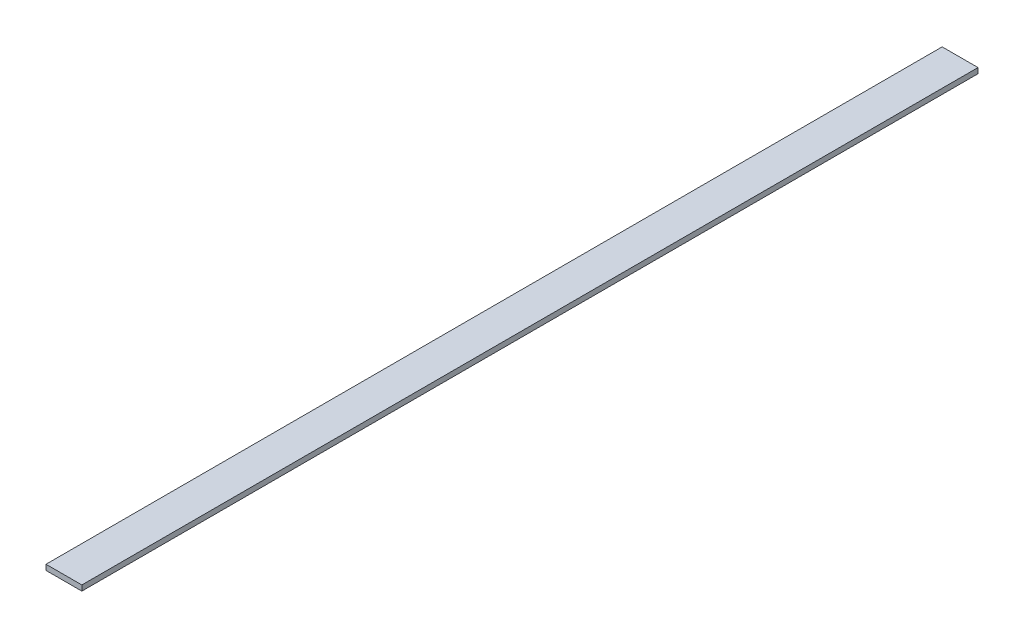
ISO-10303-21;
HEADER;
FILE_DESCRIPTION(('STEP AP214'),'2;1');
FILE_NAME('part.step','',(''),(''),'','','');
FILE_SCHEMA(('AUTOMOTIVE_DESIGN { 1 0 10303 214 1 1 1 1 }'));
ENDSEC;
DATA;
#1=APPLICATION_CONTEXT('core data for automotive mechanical design processes');
#2=APPLICATION_PROTOCOL_DEFINITION('international standard','automotive_design',2000,#1);
#3=PRODUCT_CONTEXT('',#1,'mechanical');
#4=PRODUCT('Part','Part','',(#3));
#5=PRODUCT_RELATED_PRODUCT_CATEGORY('part','',(#4));
#6=PRODUCT_DEFINITION_FORMATION('','',#4);
#7=PRODUCT_DEFINITION_CONTEXT('part definition',#1,'design');
#8=PRODUCT_DEFINITION('design','',#6,#7);
#9=PRODUCT_DEFINITION_SHAPE('','',#8);
#10=(LENGTH_UNIT() NAMED_UNIT(*) SI_UNIT(.MILLI.,.METRE.));
#11=(NAMED_UNIT(*) PLANE_ANGLE_UNIT() SI_UNIT($,.RADIAN.));
#12=(NAMED_UNIT(*) SI_UNIT($,.STERADIAN.) SOLID_ANGLE_UNIT());
#13=UNCERTAINTY_MEASURE_WITH_UNIT(LENGTH_MEASURE(1.E-05),#10,'distance_accuracy_value','');
#14=(GEOMETRIC_REPRESENTATION_CONTEXT(3) GLOBAL_UNCERTAINTY_ASSIGNED_CONTEXT((#13)) GLOBAL_UNIT_ASSIGNED_CONTEXT((#10,
#11,#12)) REPRESENTATION_CONTEXT('',''));
#15=CARTESIAN_POINT('',(0.,0.,0.));
#16=DIRECTION('',(0.,0.,1.));
#17=DIRECTION('',(1.,0.,0.));
#18=AXIS2_PLACEMENT_3D('',#15,#16,#17);
#19=CARTESIAN_POINT('',(10.,0.,0.));
#20=DIRECTION('',(-1.,0.,0.));
#21=DIRECTION('',(0.,0.,1.));
#22=AXIS2_PLACEMENT_3D('',#19,#20,#21);
#23=PLANE('',#22);
#24=DIRECTION('',(0.,-1.,0.));
#25=VECTOR('',#24,1.);
#26=CARTESIAN_POINT('',(10.,1.5,0.));
#27=LINE('',#26,#25);
#28=CARTESIAN_POINT('',(10.,3.,0.));
#29=VERTEX_POINT('',#28);
#30=CARTESIAN_POINT('',(10.,0.,0.));
#31=VERTEX_POINT('',#30);
#32=EDGE_CURVE('E51',#29,#31,#27,.T.);
#33=ORIENTED_EDGE('',*,*,#32,.F.);
#34=DIRECTION('',(0.,0.,-1.));
#35=VECTOR('',#34,1.);
#36=CARTESIAN_POINT('',(10.,3.,250.));
#37=LINE('',#36,#35);
#38=CARTESIAN_POINT('',(10.,3.,500.));
#39=VERTEX_POINT('',#38);
#40=EDGE_CURVE('E66',#39,#29,#37,.T.);
#41=ORIENTED_EDGE('',*,*,#40,.F.);
#42=DIRECTION('',(0.,-1.,0.));
#43=VECTOR('',#42,1.);
#44=CARTESIAN_POINT('',(10.,1.5,500.));
#45=LINE('',#44,#43);
#46=CARTESIAN_POINT('',(10.,0.,500.));
#47=VERTEX_POINT('',#46);
#48=EDGE_CURVE('E18',#39,#47,#45,.T.);
#49=ORIENTED_EDGE('',*,*,#48,.T.);
#50=DIRECTION('',(0.,0.,1.));
#51=VECTOR('',#50,1.);
#52=CARTESIAN_POINT('',(10.,0.,250.));
#53=LINE('',#52,#51);
#54=EDGE_CURVE('E56',#31,#47,#53,.T.);
#55=ORIENTED_EDGE('',*,*,#54,.F.);
#56=EDGE_LOOP('',(#33,#41,#49,#55));
#57=FACE_BOUND('',#56,.T.);
#58=ADVANCED_FACE('F14',(#57),#23,.F.);
#59=CARTESIAN_POINT('',(10.,0.,500.));
#60=DIRECTION('',(0.,0.,-1.));
#61=DIRECTION('',(-1.,0.,0.));
#62=AXIS2_PLACEMENT_3D('',#59,#60,#61);
#63=PLANE('',#62);
#64=DIRECTION('',(-1.,0.,0.));
#65=VECTOR('',#64,1.);
#66=CARTESIAN_POINT('',(0.,0.,500.));
#67=LINE('',#66,#65);
#68=CARTESIAN_POINT('',(-10.,0.,500.));
#69=VERTEX_POINT('',#68);
#70=EDGE_CURVE('E61',#47,#69,#67,.T.);
#71=ORIENTED_EDGE('',*,*,#70,.F.);
#72=ORIENTED_EDGE('',*,*,#48,.F.);
#73=DIRECTION('',(1.,0.,0.));
#74=VECTOR('',#73,1.);
#75=CARTESIAN_POINT('',(0.,3.,500.));
#76=LINE('',#75,#74);
#77=CARTESIAN_POINT('',(-10.,3.,500.));
#78=VERTEX_POINT('',#77);
#79=EDGE_CURVE('E79',#78,#39,#76,.T.);
#80=ORIENTED_EDGE('',*,*,#79,.F.);
#81=DIRECTION('',(0.,-1.,0.));
#82=VECTOR('',#81,1.);
#83=CARTESIAN_POINT('',(-10.,1.5,500.));
#84=LINE('',#83,#82);
#85=EDGE_CURVE('E72',#78,#69,#84,.T.);
#86=ORIENTED_EDGE('',*,*,#85,.T.);
#87=EDGE_LOOP('',(#71,#72,#80,#86));
#88=FACE_BOUND('',#87,.T.);
#89=ADVANCED_FACE('F71',(#88),#63,.F.);
#90=CARTESIAN_POINT('',(-10.,0.,500.));
#91=DIRECTION('',(0.,-1.,0.));
#92=DIRECTION('',(0.,0.,-1.));
#93=AXIS2_PLACEMENT_3D('',#90,#91,#92);
#94=PLANE('',#93);
#95=ORIENTED_EDGE('',*,*,#70,.T.);
#96=DIRECTION('',(0.,0.,-1.));
#97=VECTOR('',#96,1.);
#98=CARTESIAN_POINT('',(-10.,0.,250.));
#99=LINE('',#98,#97);
#100=CARTESIAN_POINT('',(-10.,0.,0.));
#101=VERTEX_POINT('',#100);
#102=EDGE_CURVE('E82',#69,#101,#99,.T.);
#103=ORIENTED_EDGE('',*,*,#102,.T.);
#104=DIRECTION('',(-1.,0.,0.));
#105=VECTOR('',#104,1.);
#106=CARTESIAN_POINT('',(0.,0.,0.));
#107=LINE('',#106,#105);
#108=EDGE_CURVE('E63',#31,#101,#107,.T.);
#109=ORIENTED_EDGE('',*,*,#108,.F.);
#110=ORIENTED_EDGE('',*,*,#54,.T.);
#111=EDGE_LOOP('',(#95,#103,#109,#110));
#112=FACE_BOUND('',#111,.T.);
#113=ADVANCED_FACE('F58',(#112),#94,.T.);
#114=CARTESIAN_POINT('',(10.,0.,0.));
#115=DIRECTION('',(0.,0.,-1.));
#116=DIRECTION('',(-1.,0.,0.));
#117=AXIS2_PLACEMENT_3D('',#114,#115,#116);
#118=PLANE('',#117);
#119=ORIENTED_EDGE('',*,*,#32,.T.);
#120=ORIENTED_EDGE('',*,*,#108,.T.);
#121=DIRECTION('',(0.,1.,0.));
#122=VECTOR('',#121,1.);
#123=CARTESIAN_POINT('',(-10.,1.5,0.));
#124=LINE('',#123,#122);
#125=CARTESIAN_POINT('',(-10.,3.,0.));
#126=VERTEX_POINT('',#125);
#127=EDGE_CURVE('E24',#101,#126,#124,.T.);
#128=ORIENTED_EDGE('',*,*,#127,.T.);
#129=DIRECTION('',(-1.,0.,0.));
#130=VECTOR('',#129,1.);
#131=CARTESIAN_POINT('',(0.,3.,0.));
#132=LINE('',#131,#130);
#133=EDGE_CURVE('E32',#29,#126,#132,.T.);
#134=ORIENTED_EDGE('',*,*,#133,.F.);
#135=EDGE_LOOP('',(#119,#120,#128,#134));
#136=FACE_BOUND('',#135,.T.);
#137=ADVANCED_FACE('F86',(#136),#118,.T.);
#138=CARTESIAN_POINT('',(10.,3.,0.));
#139=DIRECTION('',(0.,1.,0.));
#140=DIRECTION('',(-1.,0.,0.));
#141=AXIS2_PLACEMENT_3D('',#138,#139,#140);
#142=PLANE('',#141);
#143=DIRECTION('',(0.,0.,1.));
#144=VECTOR('',#143,1.);
#145=CARTESIAN_POINT('',(-10.,3.,250.));
#146=LINE('',#145,#144);
#147=EDGE_CURVE('E9',#126,#78,#146,.T.);
#148=ORIENTED_EDGE('',*,*,#147,.T.);
#149=ORIENTED_EDGE('',*,*,#79,.T.);
#150=ORIENTED_EDGE('',*,*,#40,.T.);
#151=ORIENTED_EDGE('',*,*,#133,.T.);
#152=EDGE_LOOP('',(#148,#149,#150,#151));
#153=FACE_BOUND('',#152,.T.);
#154=ADVANCED_FACE('F88',(#153),#142,.T.);
#155=CARTESIAN_POINT('',(-10.,0.,500.));
#156=DIRECTION('',(1.,0.,0.));
#157=DIRECTION('',(0.,0.,-1.));
#158=AXIS2_PLACEMENT_3D('',#155,#156,#157);
#159=PLANE('',#158);
#160=ORIENTED_EDGE('',*,*,#127,.F.);
#161=ORIENTED_EDGE('',*,*,#102,.F.);
#162=ORIENTED_EDGE('',*,*,#85,.F.);
#163=ORIENTED_EDGE('',*,*,#147,.F.);
#164=EDGE_LOOP('',(#160,#161,#162,#163));
#165=FACE_BOUND('',#164,.T.);
#166=ADVANCED_FACE('F16',(#165),#159,.F.);
#167=CLOSED_SHELL('',(#58,#89,#113,#137,#154,#166));
#168=MANIFOLD_SOLID_BREP('B1',#167);
#169=ADVANCED_BREP_SHAPE_REPRESENTATION('',(#18,#168),#14);
#170=SHAPE_DEFINITION_REPRESENTATION(#9,#169);
ENDSEC;
END-ISO-10303-21;
